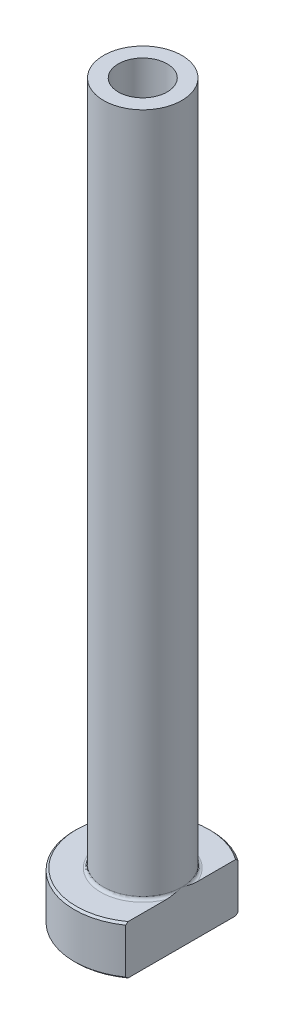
ISO-10303-21;
HEADER;
FILE_DESCRIPTION(('STEP AP214'),'2;1');
FILE_NAME('part.step','',(''),(''),'','','');
FILE_SCHEMA(('AUTOMOTIVE_DESIGN { 1 0 10303 214 1 1 1 1 }'));
ENDSEC;
DATA;
#1=APPLICATION_CONTEXT('core data for automotive mechanical design processes');
#2=APPLICATION_PROTOCOL_DEFINITION('international standard','automotive_design',2000,#1);
#3=PRODUCT_CONTEXT('',#1,'mechanical');
#4=PRODUCT('Part','Part','',(#3));
#5=PRODUCT_RELATED_PRODUCT_CATEGORY('part','',(#4));
#6=PRODUCT_DEFINITION_FORMATION('','',#4);
#7=PRODUCT_DEFINITION_CONTEXT('part definition',#1,'design');
#8=PRODUCT_DEFINITION('design','',#6,#7);
#9=PRODUCT_DEFINITION_SHAPE('','',#8);
#10=(LENGTH_UNIT() NAMED_UNIT(*) SI_UNIT(.MILLI.,.METRE.));
#11=(NAMED_UNIT(*) PLANE_ANGLE_UNIT() SI_UNIT($,.RADIAN.));
#12=(NAMED_UNIT(*) SI_UNIT($,.STERADIAN.) SOLID_ANGLE_UNIT());
#13=UNCERTAINTY_MEASURE_WITH_UNIT(LENGTH_MEASURE(1.E-05),#10,'distance_accuracy_value','');
#14=(GEOMETRIC_REPRESENTATION_CONTEXT(3) GLOBAL_UNCERTAINTY_ASSIGNED_CONTEXT((#13)) GLOBAL_UNIT_ASSIGNED_CONTEXT((#10,
#11,#12)) REPRESENTATION_CONTEXT('',''));
#15=CARTESIAN_POINT('',(0.,0.,0.));
#16=DIRECTION('',(0.,0.,1.));
#17=DIRECTION('',(1.,0.,0.));
#18=AXIS2_PLACEMENT_3D('',#15,#16,#17);
#19=CARTESIAN_POINT('',(0.,92.1876809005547,0.));
#20=DIRECTION('',(0.,1.,0.));
#21=DIRECTION('',(0.,0.,1.));
#22=AXIS2_PLACEMENT_3D('',#19,#20,#21);
#23=CYLINDRICAL_SURFACE('',#22,2.50000000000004);
#24=CARTESIAN_POINT('',(0.,75.,0.));
#25=DIRECTION('',(0.,1.,0.));
#26=DIRECTION('',(0.,0.,1.));
#27=AXIS2_PLACEMENT_3D('',#24,#25,#26);
#28=CIRCLE('',#27,2.50000000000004);
#29=CARTESIAN_POINT('',(0.,75.,2.50000000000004));
#30=VERTEX_POINT('',#29);
#31=EDGE_CURVE('E167',#30,#30,#28,.T.);
#32=ORIENTED_EDGE('',*,*,#31,.T.);
#33=EDGE_LOOP('',(#32));
#34=FACE_BOUND('',#33,.T.);
#35=CARTESIAN_POINT('',(0.,30.,0.));
#36=DIRECTION('',(0.,1.,0.));
#37=DIRECTION('',(0.,0.,1.));
#38=AXIS2_PLACEMENT_3D('',#35,#36,#37);
#39=CIRCLE('',#38,2.50000000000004);
#40=CARTESIAN_POINT('',(0.,30.,2.50000000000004));
#41=VERTEX_POINT('',#40);
#42=EDGE_CURVE('E170',#41,#41,#39,.T.);
#43=ORIENTED_EDGE('',*,*,#42,.F.);
#44=EDGE_LOOP('',(#43));
#45=FACE_BOUND('',#44,.T.);
#46=ADVANCED_FACE('F32',(#34,#45),#23,.F.);
#47=CARTESIAN_POINT('',(-2.50000000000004,75.,0.));
#48=DIRECTION('',(0.,1.,0.));
#49=DIRECTION('',(0.,0.,1.));
#50=AXIS2_PLACEMENT_3D('',#47,#48,#49);
#51=PLANE('',#50);
#52=CARTESIAN_POINT('',(0.,75.,0.));
#53=DIRECTION('',(0.,1.,0.));
#54=DIRECTION('',(0.,0.,1.));
#55=AXIS2_PLACEMENT_3D('',#52,#53,#54);
#56=CIRCLE('',#55,4.);
#57=CARTESIAN_POINT('',(0.,75.,4.));
#58=VERTEX_POINT('',#57);
#59=EDGE_CURVE('E174',#58,#58,#56,.T.);
#60=ORIENTED_EDGE('',*,*,#59,.T.);
#61=EDGE_LOOP('',(#60));
#62=FACE_BOUND('',#61,.T.);
#63=ORIENTED_EDGE('',*,*,#31,.F.);
#64=EDGE_LOOP('',(#63));
#65=FACE_BOUND('',#64,.T.);
#66=ADVANCED_FACE('F157',(#62,#65),#51,.T.);
#67=CARTESIAN_POINT('',(0.,92.1876809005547,0.));
#68=DIRECTION('',(0.,1.,0.));
#69=DIRECTION('',(0.,0.,1.));
#70=AXIS2_PLACEMENT_3D('',#67,#68,#69);
#71=CYLINDRICAL_SURFACE('',#70,3.99999999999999);
#72=CARTESIAN_POINT('',(0.,5.3,0.));
#73=DIRECTION('',(0.,1.,0.));
#74=DIRECTION('',(0.,0.,1.));
#75=AXIS2_PLACEMENT_3D('',#72,#73,#74);
#76=CIRCLE('',#75,3.99999999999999);
#77=CARTESIAN_POINT('',(3.99999999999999,5.3,0.));
#78=VERTEX_POINT('',#77);
#79=EDGE_CURVE('E180',#78,#78,#76,.T.);
#80=ORIENTED_EDGE('',*,*,#79,.T.);
#81=EDGE_LOOP('',(#80));
#82=FACE_BOUND('',#81,.T.);
#83=ORIENTED_EDGE('',*,*,#59,.F.);
#84=EDGE_LOOP('',(#83));
#85=FACE_BOUND('',#84,.T.);
#86=ADVANCED_FACE('F162',(#82,#85),#71,.T.);
#87=CARTESIAN_POINT('',(-3.99999999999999,5.,0.));
#88=DIRECTION('',(0.,1.,0.));
#89=DIRECTION('',(0.,0.,1.));
#90=AXIS2_PLACEMENT_3D('',#87,#88,#89);
#91=PLANE('',#90);
#92=DIRECTION('',(0.,0.,1.));
#93=VECTOR('',#92,1.);
#94=CARTESIAN_POINT('',(4.,5.,0.));
#95=LINE('',#94,#93);
#96=CARTESIAN_POINT('',(4.,5.,-5.49909083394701));
#97=VERTEX_POINT('',#96);
#98=CARTESIAN_POINT('',(4.,5.,-1.57797338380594));
#99=VERTEX_POINT('',#98);
#100=EDGE_CURVE('E54',#97,#99,#95,.T.);
#101=ORIENTED_EDGE('',*,*,#100,.F.);
#102=CARTESIAN_POINT('',(0.,5.,0.));
#103=DIRECTION('',(0.,1.,0.));
#104=DIRECTION('',(0.,0.,1.));
#105=AXIS2_PLACEMENT_3D('',#102,#103,#104);
#106=CIRCLE('',#105,6.8);
#107=CARTESIAN_POINT('',(3.99999999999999,5.,5.49909083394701));
#108=VERTEX_POINT('',#107);
#109=EDGE_CURVE('E186',#97,#108,#106,.T.);
#110=ORIENTED_EDGE('',*,*,#109,.T.);
#111=CARTESIAN_POINT('',(4.,5.,1.57797338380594));
#112=VERTEX_POINT('',#111);
#113=EDGE_CURVE('E134',#112,#108,#95,.T.);
#114=ORIENTED_EDGE('',*,*,#113,.F.);
#115=CARTESIAN_POINT('',(0.,5.,0.));
#116=DIRECTION('',(0.,1.,0.));
#117=DIRECTION('',(0.,0.,1.));
#118=AXIS2_PLACEMENT_3D('',#115,#116,#117);
#119=CIRCLE('',#118,4.29999999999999);
#120=EDGE_CURVE('E183',#112,#99,#119,.F.);
#121=ORIENTED_EDGE('',*,*,#120,.T.);
#122=EDGE_LOOP('',(#101,#110,#114,#121));
#123=FACE_BOUND('',#122,.T.);
#124=ADVANCED_FACE('F197',(#123),#91,.T.);
#125=CARTESIAN_POINT('',(0.,92.1876809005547,0.));
#126=DIRECTION('',(0.,1.,0.));
#127=DIRECTION('',(0.,0.,1.));
#128=AXIS2_PLACEMENT_3D('',#125,#126,#127);
#129=CYLINDRICAL_SURFACE('',#128,6.99999999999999);
#130=DIRECTION('',(0.,-1.,0.));
#131=VECTOR('',#130,1.);
#132=CARTESIAN_POINT('',(3.99999999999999,75.,5.74456264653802));
#133=LINE('',#132,#131);
#134=CARTESIAN_POINT('',(3.99999999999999,4.8,5.74456264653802));
#135=VERTEX_POINT('',#134);
#136=CARTESIAN_POINT('',(3.99999999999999,0.199999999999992,5.74456264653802));
#137=VERTEX_POINT('',#136);
#138=EDGE_CURVE('E82',#135,#137,#133,.T.);
#139=ORIENTED_EDGE('',*,*,#138,.F.);
#140=CARTESIAN_POINT('',(0.,4.8,0.));
#141=DIRECTION('',(0.,1.,0.));
#142=DIRECTION('',(0.,0.,1.));
#143=AXIS2_PLACEMENT_3D('',#140,#141,#142);
#144=CIRCLE('',#143,6.99999999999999);
#145=CARTESIAN_POINT('',(4.,4.8,-5.74456264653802));
#146=VERTEX_POINT('',#145);
#147=EDGE_CURVE('E95',#135,#146,#144,.F.);
#148=ORIENTED_EDGE('',*,*,#147,.T.);
#149=DIRECTION('',(0.,-1.,0.));
#150=VECTOR('',#149,1.);
#151=CARTESIAN_POINT('',(4.,75.,-5.74456264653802));
#152=LINE('',#151,#150);
#153=CARTESIAN_POINT('',(4.,0.199999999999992,-5.74456264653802));
#154=VERTEX_POINT('',#153);
#155=EDGE_CURVE('E192',#146,#154,#152,.T.);
#156=ORIENTED_EDGE('',*,*,#155,.T.);
#157=CARTESIAN_POINT('',(0.,0.199999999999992,0.));
#158=DIRECTION('',(0.,-1.,0.));
#159=DIRECTION('',(0.,0.,-1.));
#160=AXIS2_PLACEMENT_3D('',#157,#158,#159);
#161=CIRCLE('',#160,6.99999999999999);
#162=EDGE_CURVE('E98',#154,#137,#161,.F.);
#163=ORIENTED_EDGE('',*,*,#162,.T.);
#164=EDGE_LOOP('',(#139,#148,#156,#163));
#165=FACE_BOUND('',#164,.T.);
#166=ADVANCED_FACE('F190',(#165),#129,.T.);
#167=CARTESIAN_POINT('',(-6.99999999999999,0.,0.));
#168=DIRECTION('',(0.,-1.,0.));
#169=DIRECTION('',(0.,0.,-1.));
#170=AXIS2_PLACEMENT_3D('',#167,#168,#169);
#171=PLANE('',#170);
#172=CARTESIAN_POINT('',(0.,0.,0.));
#173=DIRECTION('',(0.,-1.,0.));
#174=DIRECTION('',(0.,0.,-1.));
#175=AXIS2_PLACEMENT_3D('',#172,#173,#174);
#176=CIRCLE('',#175,3.25);
#177=CARTESIAN_POINT('',(0.,0.,-3.25));
#178=VERTEX_POINT('',#177);
#179=EDGE_CURVE('E40',#178,#178,#176,.F.);
#180=ORIENTED_EDGE('',*,*,#179,.T.);
#181=EDGE_LOOP('',(#180));
#182=FACE_BOUND('',#181,.T.);
#183=DIRECTION('',(0.,0.,-1.));
#184=VECTOR('',#183,1.);
#185=CARTESIAN_POINT('',(3.99999999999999,0.,5.74456264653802));
#186=LINE('',#185,#184);
#187=CARTESIAN_POINT('',(3.99999999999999,0.,5.49909083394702));
#188=VERTEX_POINT('',#187);
#189=CARTESIAN_POINT('',(4.,0.,-5.49909083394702));
#190=VERTEX_POINT('',#189);
#191=EDGE_CURVE('E47',#188,#190,#186,.T.);
#192=ORIENTED_EDGE('',*,*,#191,.F.);
#193=CARTESIAN_POINT('',(0.,0.,0.));
#194=DIRECTION('',(0.,-1.,0.));
#195=DIRECTION('',(0.,0.,-1.));
#196=AXIS2_PLACEMENT_3D('',#193,#194,#195);
#197=CIRCLE('',#196,6.80000000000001);
#198=EDGE_CURVE('E92',#188,#190,#197,.T.);
#199=ORIENTED_EDGE('',*,*,#198,.T.);
#200=EDGE_LOOP('',(#192,#199));
#201=FACE_BOUND('',#200,.T.);
#202=ADVANCED_FACE('F91',(#182,#201),#171,.T.);
#203=CARTESIAN_POINT('',(0.,92.1876809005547,0.));
#204=DIRECTION('',(0.,1.,0.));
#205=DIRECTION('',(0.,0.,1.));
#206=AXIS2_PLACEMENT_3D('',#203,#204,#205);
#207=CYLINDRICAL_SURFACE('',#206,2.74999999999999);
#208=CARTESIAN_POINT('',(0.,0.5,0.));
#209=DIRECTION('',(0.,-1.,0.));
#210=DIRECTION('',(0.,0.,-1.));
#211=AXIS2_PLACEMENT_3D('',#208,#209,#210);
#212=CIRCLE('',#211,2.74999999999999);
#213=CARTESIAN_POINT('',(0.,0.5,-2.74999999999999));
#214=VERTEX_POINT('',#213);
#215=EDGE_CURVE('E11',#214,#214,#212,.T.);
#216=ORIENTED_EDGE('',*,*,#215,.T.);
#217=EDGE_LOOP('',(#216));
#218=FACE_BOUND('',#217,.T.);
#219=CARTESIAN_POINT('',(0.,18.,0.));
#220=DIRECTION('',(0.,1.,0.));
#221=DIRECTION('',(0.,0.,1.));
#222=AXIS2_PLACEMENT_3D('',#219,#220,#221);
#223=CIRCLE('',#222,2.74999999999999);
#224=CARTESIAN_POINT('',(0.,18.,2.74999999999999));
#225=VERTEX_POINT('',#224);
#226=EDGE_CURVE('E172',#225,#225,#223,.T.);
#227=ORIENTED_EDGE('',*,*,#226,.T.);
#228=EDGE_LOOP('',(#227));
#229=FACE_BOUND('',#228,.T.);
#230=ADVANCED_FACE('F215',(#218,#229),#207,.F.);
#231=CARTESIAN_POINT('',(0.,18.,0.));
#232=DIRECTION('',(0.,-1.,0.));
#233=DIRECTION('',(0.,0.,-1.));
#234=AXIS2_PLACEMENT_3D('',#231,#232,#233);
#235=CONICAL_SURFACE('',#234,2.74999999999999,0.0208303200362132);
#236=ORIENTED_EDGE('',*,*,#42,.T.);
#237=EDGE_LOOP('',(#236));
#238=FACE_BOUND('',#237,.T.);
#239=ORIENTED_EDGE('',*,*,#226,.F.);
#240=EDGE_LOOP('',(#239));
#241=FACE_BOUND('',#240,.T.);
#242=ADVANCED_FACE('F111',(#238,#241),#235,.F.);
#243=CARTESIAN_POINT('',(0.,5.3,0.));
#244=DIRECTION('',(0.,1.,0.));
#245=DIRECTION('',(0.,0.,1.));
#246=AXIS2_PLACEMENT_3D('',#243,#244,#245);
#247=TOROIDAL_SURFACE('',#246,4.29999999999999,0.3);
#248=ORIENTED_EDGE('',*,*,#120,.F.);
#249=CARTESIAN_POINT('',(3.99999999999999,5.3,0.));
#250=CARTESIAN_POINT('',(3.99999999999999,5.30000062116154,-1.06250692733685E-10));
#251=CARTESIAN_POINT('',(3.99999999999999,5.30000124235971,2.17725991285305E-07));
#252=CARTESIAN_POINT('',(3.99999999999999,5.30000240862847,8.36140834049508E-07));
#253=CARTESIAN_POINT('',(3.99999999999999,5.30000294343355,1.2501166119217E-06));
#254=CARTESIAN_POINT('',(3.99999999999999,5.3000040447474,2.23959309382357E-06));
#255=CARTESIAN_POINT('',(3.99999999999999,5.30000459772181,2.83084427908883E-06));
#256=CARTESIAN_POINT('',(3.99999999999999,5.30000559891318,4.06516564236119E-06));
#257=CARTESIAN_POINT('',(3.99999999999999,5.30000604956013,4.70640046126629E-06));
#258=CARTESIAN_POINT('',(3.99999999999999,5.30000769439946,7.15677144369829E-06));
#259=CARTESIAN_POINT('',(3.99999999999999,5.3000087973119,9.02995892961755E-06));
#260=CARTESIAN_POINT('',(3.99999999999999,5.30001063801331,1.27664878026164E-05));
#261=CARTESIAN_POINT('',(3.99999999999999,5.30001139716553,1.46197798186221E-05));
#262=CARTESIAN_POINT('',(3.99999999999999,5.3000145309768,2.23679207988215E-05));
#263=CARTESIAN_POINT('',(3.99999999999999,5.30001683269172,2.82968730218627E-05));
#264=CARTESIAN_POINT('',(3.99999999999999,5.30002027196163,3.95668707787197E-05));
#265=CARTESIAN_POINT('',(3.99999999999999,5.30002152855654,4.48715441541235E-05));
#266=CARTESIAN_POINT('',(3.99999999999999,5.30003060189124,8.40118167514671E-05));
#267=CARTESIAN_POINT('',(4.,5.30003739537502,0.000118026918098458));
#268=CARTESIAN_POINT('',(4.,5.30006713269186,0.000252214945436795));
#269=CARTESIAN_POINT('',(4.,5.30009559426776,0.000351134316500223));
#270=CARTESIAN_POINT('',(3.99999999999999,5.30020622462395,0.000742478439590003));
#271=CARTESIAN_POINT('',(3.99999999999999,5.30028475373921,0.00103561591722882));
#272=CARTESIAN_POINT('',(4.,5.3005988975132,0.0021992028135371));
#273=CARTESIAN_POINT('',(4.,5.30083905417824,0.0030687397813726));
#274=CARTESIAN_POINT('',(3.99999999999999,5.30183682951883,0.00669141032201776));
#275=CARTESIAN_POINT('',(3.99999999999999,5.30258877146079,0.00944568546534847));
#276=CARTESIAN_POINT('',(4.,5.31066890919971,0.0390293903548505));
#277=CARTESIAN_POINT('',(4.,5.31802631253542,0.0658531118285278));
#278=CARTESIAN_POINT('',(3.99999999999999,5.33239676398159,0.118441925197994));
#279=CARTESIAN_POINT('',(3.99999999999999,5.33941183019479,0.14420651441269));
#280=CARTESIAN_POINT('',(4.,5.35427366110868,0.199017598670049));
#281=CARTESIAN_POINT('',(4.,5.36211313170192,0.228066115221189));
#282=CARTESIAN_POINT('',(4.,5.37776349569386,0.28651184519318));
#283=CARTESIAN_POINT('',(4.,5.38557313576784,0.315909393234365));
#284=CARTESIAN_POINT('',(4.,5.40425662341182,0.386994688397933));
#285=CARTESIAN_POINT('',(4.,5.41505237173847,0.428703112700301));
#286=CARTESIAN_POINT('',(4.,5.43592310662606,0.511098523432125));
#287=CARTESIAN_POINT('',(4.,5.44600969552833,0.551782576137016));
#288=CARTESIAN_POINT('',(4.,5.47850986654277,0.686599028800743));
#289=CARTESIAN_POINT('',(4.,5.49978370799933,0.781011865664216));
#290=CARTESIAN_POINT('',(4.,5.53807543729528,0.971847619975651));
#291=CARTESIAN_POINT('',(4.,5.55504273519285,1.06828120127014));
#292=CARTESIAN_POINT('',(4.,5.57582405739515,1.21752725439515));
#293=CARTESIAN_POINT('',(4.,5.58209796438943,1.26999379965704));
#294=CARTESIAN_POINT('',(4.,5.59210686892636,1.37516324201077));
#295=CARTESIAN_POINT('',(4.,5.59584265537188,1.42786606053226));
#296=CARTESIAN_POINT('',(4.,5.60010438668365,1.53310673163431));
#297=CARTESIAN_POINT('',(4.,5.6006487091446,1.58564378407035));
#298=CARTESIAN_POINT('',(4.,5.59767158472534,1.69058605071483));
#299=CARTESIAN_POINT('',(4.,5.59415502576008,1.74299134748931));
#300=CARTESIAN_POINT('',(4.,5.58503062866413,1.8190329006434));
#301=CARTESIAN_POINT('',(4.,5.58157617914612,1.84292934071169));
#302=CARTESIAN_POINT('',(4.,5.5732995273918,1.89051061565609));
#303=CARTESIAN_POINT('',(4.,5.56847619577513,1.91419525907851));
#304=CARTESIAN_POINT('',(4.,5.55726644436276,1.96092888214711));
#305=CARTESIAN_POINT('',(4.,5.55089740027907,1.98398195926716));
#306=CARTESIAN_POINT('',(4.,5.53623434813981,2.0294555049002));
#307=CARTESIAN_POINT('',(4.,5.52794253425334,2.05187666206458));
#308=CARTESIAN_POINT('',(4.,5.50887098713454,2.09590631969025));
#309=CARTESIAN_POINT('',(4.,5.49806837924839,2.1175050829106));
#310=CARTESIAN_POINT('',(4.,5.47333401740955,2.15885583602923));
#311=CARTESIAN_POINT('',(4.,5.45941272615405,2.17861369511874));
#312=CARTESIAN_POINT('',(4.,5.43588221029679,2.20522942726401));
#313=CARTESIAN_POINT('',(4.,5.42781139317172,2.21344043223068));
#314=CARTESIAN_POINT('',(4.,5.41065114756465,2.22875149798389));
#315=CARTESIAN_POINT('',(4.,5.40156129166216,2.23585108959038));
#316=CARTESIAN_POINT('',(4.,5.38220524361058,2.24859694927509));
#317=CARTESIAN_POINT('',(4.,5.37192420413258,2.25422119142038));
#318=CARTESIAN_POINT('',(4.,5.35045072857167,2.26331064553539));
#319=CARTESIAN_POINT('',(4.,5.33926122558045,2.26678251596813));
#320=CARTESIAN_POINT('',(4.,5.31952044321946,2.27051268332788));
#321=CARTESIAN_POINT('',(4.,5.31108453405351,2.27139016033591));
#322=CARTESIAN_POINT('',(4.,5.29418624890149,2.2716896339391));
#323=CARTESIAN_POINT('',(4.,5.28572387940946,2.27111196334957));
#324=CARTESIAN_POINT('',(4.,5.26904138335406,2.26855580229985));
#325=CARTESIAN_POINT('',(4.,5.26082066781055,2.26658107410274));
#326=CARTESIAN_POINT('',(4.,5.24478214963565,2.26139496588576));
#327=CARTESIAN_POINT('',(4.,5.23696461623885,2.25818277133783));
#328=CARTESIAN_POINT('',(4.,5.21851235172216,2.24908332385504));
#329=CARTESIAN_POINT('',(4.,5.20815219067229,2.24264095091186));
#330=CARTESIAN_POINT('',(4.,5.18857975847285,2.22819957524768));
#331=CARTESIAN_POINT('',(4.,5.17937061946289,2.22019647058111));
#332=CARTESIAN_POINT('',(4.,5.15665383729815,2.19777756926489));
#333=CARTESIAN_POINT('',(4.,5.14403484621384,2.18246908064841));
#334=CARTESIAN_POINT('',(4.,5.12118369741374,2.15020843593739));
#335=CARTESIAN_POINT('',(4.,5.11095480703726,2.13325407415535));
#336=CARTESIAN_POINT('',(4.,5.09273574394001,2.09892324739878));
#337=CARTESIAN_POINT('',(4.,5.08468212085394,2.08157988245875));
#338=CARTESIAN_POINT('',(4.,5.07005901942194,2.04627072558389));
#339=CARTESIAN_POINT('',(4.,5.06349101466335,2.02830433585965));
#340=CARTESIAN_POINT('',(4.,5.04555485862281,1.97350761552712));
#341=CARTESIAN_POINT('',(4.,5.03608974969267,1.93605770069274));
#342=CARTESIAN_POINT('',(4.,5.0178056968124,1.8452923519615));
#343=CARTESIAN_POINT('',(4.,5.01077018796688,1.79164082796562));
#344=CARTESIAN_POINT('',(4.,5.00182846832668,1.6837994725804));
#345=CARTESIAN_POINT('',(4.,4.99993887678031,1.62960846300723));
#346=CARTESIAN_POINT('',(4.,5.00006129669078,1.52361204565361));
#347=CARTESIAN_POINT('',(4.,5.00190698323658,1.4718055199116));
#348=CARTESIAN_POINT('',(4.,5.00841243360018,1.36835357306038));
#349=CARTESIAN_POINT('',(4.,5.01307376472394,1.31670825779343));
#350=CARTESIAN_POINT('',(4.,5.02905484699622,1.17431887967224));
#351=CARTESIAN_POINT('',(4.,5.04274090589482,1.08384207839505));
#352=CARTESIAN_POINT('',(4.,5.06701714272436,0.947757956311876));
#353=CARTESIAN_POINT('',(4.,5.07585573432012,0.901814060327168));
#354=CARTESIAN_POINT('',(4.,5.09458665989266,0.810008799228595));
#355=CARTESIAN_POINT('',(4.,5.10448180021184,0.764148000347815));
#356=CARTESIAN_POINT('',(4.,5.1289243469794,0.655631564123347));
#357=CARTESIAN_POINT('',(4.,5.14383556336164,0.593058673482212));
#358=CARTESIAN_POINT('',(4.,5.17458762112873,0.468885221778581));
#359=CARTESIAN_POINT('',(4.,5.19041623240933,0.407281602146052));
#360=CARTESIAN_POINT('',(3.99999999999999,5.22090834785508,0.291232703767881));
#361=CARTESIAN_POINT('',(3.99999999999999,5.23550024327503,0.236768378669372));
#362=CARTESIAN_POINT('',(4.,5.26562550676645,0.125604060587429));
#363=CARTESIAN_POINT('',(4.00000000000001,5.28117250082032,0.0689076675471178));
#364=CARTESIAN_POINT('',(3.99999999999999,5.29741226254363,0.00944154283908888));
#365=CARTESIAN_POINT('',(3.99999999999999,5.29816540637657,0.00668315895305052));
#366=CARTESIAN_POINT('',(4.,5.29916346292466,0.00305954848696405));
#367=CARTESIAN_POINT('',(4.,5.29940273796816,0.00219318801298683));
#368=CARTESIAN_POINT('',(3.99999999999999,5.29971580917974,0.00103357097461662));
#369=CARTESIAN_POINT('',(3.99999999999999,5.29979412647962,0.000741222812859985));
#370=CARTESIAN_POINT('',(4.,5.29990450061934,0.00035080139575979));
#371=CARTESIAN_POINT('',(4.,5.29993292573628,0.00025201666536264));
#372=CARTESIAN_POINT('',(4.,5.2999626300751,0.000117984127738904));
#373=CARTESIAN_POINT('',(3.99999999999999,5.29996941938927,8.39881851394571E-05));
#374=CARTESIAN_POINT('',(3.99999999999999,5.29997848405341,4.48673984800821E-05));
#375=CARTESIAN_POINT('',(3.99999999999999,5.29997973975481,3.95638156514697E-05));
#376=CARTESIAN_POINT('',(3.99999999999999,5.29998317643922,2.82960308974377E-05));
#377=CARTESIAN_POINT('',(3.99999999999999,5.29998547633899,2.236814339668E-05));
#378=CARTESIAN_POINT('',(3.99999999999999,5.29998860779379,1.46210987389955E-05));
#379=CARTESIAN_POINT('',(3.99999999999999,5.29998936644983,1.27678884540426E-05));
#380=CARTESIAN_POINT('',(3.99999999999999,5.29999120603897,9.03143915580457E-06));
#381=CARTESIAN_POINT('',(3.99999999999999,5.29999230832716,7.1582397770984E-06));
#382=CARTESIAN_POINT('',(3.99999999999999,5.29999395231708,4.70775453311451E-06));
#383=CARTESIAN_POINT('',(3.99999999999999,5.29999440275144,4.06646315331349E-06));
#384=CARTESIAN_POINT('',(3.99999999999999,5.2999954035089,2.83199030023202E-06));
#385=CARTESIAN_POINT('',(3.99999999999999,5.29999595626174,2.24064296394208E-06));
#386=CARTESIAN_POINT('',(3.99999999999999,5.29999705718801,1.25093940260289E-06));
#387=CARTESIAN_POINT('',(3.99999999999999,5.29999759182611,8.36840805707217E-07));
#388=CARTESIAN_POINT('',(3.99999999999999,5.29999875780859,2.18117629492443E-07));
#389=CARTESIAN_POINT('',(3.99999999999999,5.29999937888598,1.06243770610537E-10));
#390=CARTESIAN_POINT('',(3.99999999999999,5.3,0.));
#391=B_SPLINE_CURVE_WITH_KNOTS('',3,(#249,#250,#251,#252,#253,#254,#255,#256,#257,#258,#259,
#260,#261,#262,#263,#264,#265,#266,#267,#268,#269,#270,#271,#272,#273,#274,#275,#276,#277,#278,
#279,#280,#281,#282,#283,#284,#285,#286,#287,#288,#289,#290,#291,#292,#293,#294,#295,#296,#297,
#298,#299,#300,#301,#302,#303,#304,#305,#306,#307,#308,#309,#310,#311,#312,#313,#314,#315,#316,
#317,#318,#319,#320,#321,#322,#323,#324,#325,#326,#327,#328,#329,#330,#331,#332,#333,#334,#335,
#336,#337,#338,#339,#340,#341,#342,#343,#344,#345,#346,#347,#348,#349,#350,#351,#352,#353,#354,
#355,#356,#357,#358,#359,#360,#361,#362,#363,#364,#365,#366,#367,#368,#369,#370,#371,#372,#373,
#374,#375,#376,#377,#378,#379,#380,#381,#382,#383,#384,#385,#386,#387,#388,#389,#390),
.UNSPECIFIED.,.T.,.F.,(4,2,2,2,2,2,2,2,2,2,2,2,2,2,2,2,2,2,2,2,2,2,2,2,2,2,2,2,2,2,2,2,2,2,2,2,
2,2,2,2,2,2,2,2,2,2,2,2,2,2,2,2,2,2,2,2,2,2,2,2,2,2,2,2,2,2,2,2,2,2,4),(0.,1.87484564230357E-06,
3.9018029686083E-06,6.31684198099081E-06,8.66652435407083E-06,1.51627608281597E-05,
2.11658001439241E-05,4.02090842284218E-05,5.65429557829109E-05,0.000160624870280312,
0.000469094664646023,0.00137985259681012,0.00408571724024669,0.0126514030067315,
0.0960918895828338,0.176200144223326,0.266463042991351,0.357714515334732,0.48696124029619,
0.612707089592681,0.902988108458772,1.19653589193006,1.35501075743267,1.51343634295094,
1.6709487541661,1.82827177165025,1.90067591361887,1.97313996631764,2.04482437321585,
2.11642737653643,2.188710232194,2.2607541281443,2.29521947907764,2.32969934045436,
2.36466792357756,2.39952778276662,2.42485422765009,2.45017488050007,2.47542760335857,
2.50069697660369,2.53708899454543,2.57357798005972,2.63276032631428,2.69202310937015,
2.74930315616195,2.80663977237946,2.92223125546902,3.08420752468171,3.24670629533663,
3.40212850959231,3.55763731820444,3.83192962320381,3.9722838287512,4.11302057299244,
4.3059813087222,4.49678885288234,4.66594443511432,4.84230602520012,4.85088453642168,
4.85358051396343,4.8544888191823,4.85479687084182,4.85490089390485,4.85491722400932,
4.85493626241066,4.85494226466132,4.85494875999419,4.85495110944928,4.85495352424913,
4.85495555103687,4.85495742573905),.UNSPECIFIED.);
#392=EDGE_CURVE('E126',#112,#78,#391,.T.);
#393=ORIENTED_EDGE('',*,*,#392,.T.);
#394=ORIENTED_EDGE('',*,*,#79,.F.);
#395=CARTESIAN_POINT('',(3.99999999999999,5.3,0.));
#396=CARTESIAN_POINT('',(3.99999999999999,5.29999937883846,1.0625180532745E-10));
#397=CARTESIAN_POINT('',(3.99999999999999,5.29999875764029,-2.17725990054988E-07));
#398=CARTESIAN_POINT('',(3.99999999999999,5.29999759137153,-8.36140832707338E-07));
#399=CARTESIAN_POINT('',(3.99999999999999,5.29999705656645,-1.25011661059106E-06));
#400=CARTESIAN_POINT('',(3.99999999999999,5.2999959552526,-2.23959309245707E-06));
#401=CARTESIAN_POINT('',(3.99999999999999,5.29999540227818,-2.83084427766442E-06));
#402=CARTESIAN_POINT('',(3.99999999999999,5.29999440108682,-4.06516564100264E-06));
#403=CARTESIAN_POINT('',(3.99999999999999,5.29999395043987,-4.70640046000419E-06));
#404=CARTESIAN_POINT('',(3.99999999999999,5.29999230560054,-7.15677144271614E-06));
#405=CARTESIAN_POINT('',(3.99999999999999,5.2999912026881,-9.02995892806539E-06));
#406=CARTESIAN_POINT('',(3.99999999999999,5.29998936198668,-1.27664878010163E-05));
#407=CARTESIAN_POINT('',(3.99999999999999,5.29998860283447,-1.46197798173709E-05));
#408=CARTESIAN_POINT('',(3.99999999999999,5.2999854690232,-2.23679207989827E-05));
#409=CARTESIAN_POINT('',(3.99999999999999,5.29998316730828,-2.82968730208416E-05));
#410=CARTESIAN_POINT('',(3.99999999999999,5.29997972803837,-3.95668707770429E-05));
#411=CARTESIAN_POINT('',(3.99999999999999,5.29997847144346,-4.48715441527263E-05));
#412=CARTESIAN_POINT('',(3.99999999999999,5.29996939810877,-8.40118167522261E-05));
#413=CARTESIAN_POINT('',(4.,5.29996260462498,-0.000118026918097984));
#414=CARTESIAN_POINT('',(4.,5.29993286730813,-0.000252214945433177));
#415=CARTESIAN_POINT('',(4.,5.29990440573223,-0.000351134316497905));
#416=CARTESIAN_POINT('',(3.99999999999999,5.29979377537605,-0.000742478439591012));
#417=CARTESIAN_POINT('',(3.99999999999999,5.29971524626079,-0.00103561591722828));
#418=CARTESIAN_POINT('',(4.,5.29940110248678,-0.00219920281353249));
#419=CARTESIAN_POINT('',(4.,5.29916094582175,-0.00306873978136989));
#420=CARTESIAN_POINT('',(3.99999999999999,5.29816317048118,-0.00669141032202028));
#421=CARTESIAN_POINT('',(3.99999999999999,5.29741122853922,-0.00944568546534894));
#422=CARTESIAN_POINT('',(4.,5.28933109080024,-0.0390293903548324));
#423=CARTESIAN_POINT('',(4.,5.28197368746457,-0.0658531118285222));
#424=CARTESIAN_POINT('',(3.99999999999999,5.26760323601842,-0.118441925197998));
#425=CARTESIAN_POINT('',(3.99999999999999,5.26058816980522,-0.144206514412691));
#426=CARTESIAN_POINT('',(4.,5.24572633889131,-0.199017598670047));
#427=CARTESIAN_POINT('',(4.,5.23788686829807,-0.228066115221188));
#428=CARTESIAN_POINT('',(4.,5.22223650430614,-0.28651184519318));
#429=CARTESIAN_POINT('',(4.,5.21442686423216,-0.315909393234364));
#430=CARTESIAN_POINT('',(4.,5.19574337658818,-0.386994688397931));
#431=CARTESIAN_POINT('',(4.,5.18494762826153,-0.428703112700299));
#432=CARTESIAN_POINT('',(4.,5.16407689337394,-0.511098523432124));
#433=CARTESIAN_POINT('',(4.,5.15399030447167,-0.551782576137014));
#434=CARTESIAN_POINT('',(4.,5.12149013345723,-0.68659902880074));
#435=CARTESIAN_POINT('',(4.,5.10021629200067,-0.781011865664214));
#436=CARTESIAN_POINT('',(4.,5.06192456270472,-0.97184761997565));
#437=CARTESIAN_POINT('',(4.,5.04495726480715,-1.06828120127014));
#438=CARTESIAN_POINT('',(4.,5.02417594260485,-1.21752725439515));
#439=CARTESIAN_POINT('',(4.,5.01790203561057,-1.26999379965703));
#440=CARTESIAN_POINT('',(4.,5.00789313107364,-1.37516324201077));
#441=CARTESIAN_POINT('',(4.,5.00415734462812,-1.42786606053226));
#442=CARTESIAN_POINT('',(4.,4.99989561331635,-1.5331067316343));
#443=CARTESIAN_POINT('',(4.,4.9993512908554,-1.58564378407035));
#444=CARTESIAN_POINT('',(4.,5.00232841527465,-1.69058605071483));
#445=CARTESIAN_POINT('',(4.,5.00584497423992,-1.74299134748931));
#446=CARTESIAN_POINT('',(4.,5.01496937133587,-1.8190329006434));
#447=CARTESIAN_POINT('',(4.,5.01842382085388,-1.84292934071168));
#448=CARTESIAN_POINT('',(4.,5.0267004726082,-1.89051061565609));
#449=CARTESIAN_POINT('',(4.,5.03152380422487,-1.9141952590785));
#450=CARTESIAN_POINT('',(4.,5.04273355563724,-1.96092888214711));
#451=CARTESIAN_POINT('',(4.,5.04910259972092,-1.98398195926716));
#452=CARTESIAN_POINT('',(4.,5.06376565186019,-2.0294555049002));
#453=CARTESIAN_POINT('',(4.,5.07205746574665,-2.05187666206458));
#454=CARTESIAN_POINT('',(4.,5.09112901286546,-2.09590631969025));
#455=CARTESIAN_POINT('',(4.,5.10193162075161,-2.1175050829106));
#456=CARTESIAN_POINT('',(4.,5.12666598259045,-2.15885583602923));
#457=CARTESIAN_POINT('',(4.,5.14058727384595,-2.17861369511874));
#458=CARTESIAN_POINT('',(4.,5.16411778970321,-2.20522942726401));
#459=CARTESIAN_POINT('',(4.,5.17218860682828,-2.21344043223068));
#460=CARTESIAN_POINT('',(4.,5.18934885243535,-2.22875149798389));
#461=CARTESIAN_POINT('',(4.,5.19843870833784,-2.23585108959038));
#462=CARTESIAN_POINT('',(4.,5.21779475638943,-2.24859694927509));
#463=CARTESIAN_POINT('',(4.,5.22807579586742,-2.25422119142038));
#464=CARTESIAN_POINT('',(4.,5.24954927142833,-2.26331064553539));
#465=CARTESIAN_POINT('',(4.,5.26073877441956,-2.26678251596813));
#466=CARTESIAN_POINT('',(4.,5.28047955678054,-2.27051268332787));
#467=CARTESIAN_POINT('',(4.,5.28891546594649,-2.27139016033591));
#468=CARTESIAN_POINT('',(4.,5.30581375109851,-2.2716896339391));
#469=CARTESIAN_POINT('',(4.,5.31427612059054,-2.27111196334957));
#470=CARTESIAN_POINT('',(4.,5.33095861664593,-2.26855580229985));
#471=CARTESIAN_POINT('',(4.,5.33917933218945,-2.26658107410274));
#472=CARTESIAN_POINT('',(4.,5.35521785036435,-2.26139496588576));
#473=CARTESIAN_POINT('',(4.,5.36303538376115,-2.25818277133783));
#474=CARTESIAN_POINT('',(4.,5.38148764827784,-2.24908332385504));
#475=CARTESIAN_POINT('',(4.,5.3918478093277,-2.24264095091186));
#476=CARTESIAN_POINT('',(4.,5.41142024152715,-2.22819957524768));
#477=CARTESIAN_POINT('',(4.,5.4206293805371,-2.22019647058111));
#478=CARTESIAN_POINT('',(4.,5.44334616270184,-2.19777756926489));
#479=CARTESIAN_POINT('',(4.,5.45596515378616,-2.18246908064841));
#480=CARTESIAN_POINT('',(4.,5.47881630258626,-2.15020843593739));
#481=CARTESIAN_POINT('',(4.,5.48904519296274,-2.13325407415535));
#482=CARTESIAN_POINT('',(4.,5.50726425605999,-2.09892324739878));
#483=CARTESIAN_POINT('',(4.,5.51531787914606,-2.08157988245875));
#484=CARTESIAN_POINT('',(4.,5.52994098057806,-2.04627072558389));
#485=CARTESIAN_POINT('',(4.,5.53650898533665,-2.02830433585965));
#486=CARTESIAN_POINT('',(4.,5.55444514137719,-1.97350761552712));
#487=CARTESIAN_POINT('',(4.,5.56391025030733,-1.93605770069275));
#488=CARTESIAN_POINT('',(4.,5.5821943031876,-1.8452923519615));
#489=CARTESIAN_POINT('',(4.,5.58922981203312,-1.79164082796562));
#490=CARTESIAN_POINT('',(4.,5.59817153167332,-1.6837994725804));
#491=CARTESIAN_POINT('',(4.,5.60006112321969,-1.62960846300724));
#492=CARTESIAN_POINT('',(4.,5.59993870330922,-1.52361204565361));
#493=CARTESIAN_POINT('',(4.,5.59809301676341,-1.47180551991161));
#494=CARTESIAN_POINT('',(4.,5.59158756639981,-1.36835357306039));
#495=CARTESIAN_POINT('',(4.,5.58692623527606,-1.31670825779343));
#496=CARTESIAN_POINT('',(4.,5.57094515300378,-1.17431887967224));
#497=CARTESIAN_POINT('',(4.,5.55725909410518,-1.08384207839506));
#498=CARTESIAN_POINT('',(4.,5.53298285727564,-0.947757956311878));
#499=CARTESIAN_POINT('',(4.,5.52414426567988,-0.901814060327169));
#500=CARTESIAN_POINT('',(4.,5.50541334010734,-0.810008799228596));
#501=CARTESIAN_POINT('',(4.,5.49551819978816,-0.764148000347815));
#502=CARTESIAN_POINT('',(4.,5.4710756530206,-0.655631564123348));
#503=CARTESIAN_POINT('',(4.,5.45616443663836,-0.593058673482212));
#504=CARTESIAN_POINT('',(4.,5.42541237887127,-0.468885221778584));
#505=CARTESIAN_POINT('',(4.,5.40958376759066,-0.407281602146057));
#506=CARTESIAN_POINT('',(3.99999999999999,5.37909165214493,-0.29123270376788));
#507=CARTESIAN_POINT('',(3.99999999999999,5.364499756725,-0.236768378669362));
#508=CARTESIAN_POINT('',(4.,5.33437449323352,-0.125604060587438));
#509=CARTESIAN_POINT('',(4.00000000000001,5.31882749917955,-0.0689076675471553));
#510=CARTESIAN_POINT('',(3.99999999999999,5.30258773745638,-0.00944154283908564));
#511=CARTESIAN_POINT('',(3.99999999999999,5.30183459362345,-0.00668315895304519));
#512=CARTESIAN_POINT('',(4.,5.30083653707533,-0.00305954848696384));
#513=CARTESIAN_POINT('',(4.,5.30059726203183,-0.00219318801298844));
#514=CARTESIAN_POINT('',(3.99999999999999,5.30028419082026,-0.00103357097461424));
#515=CARTESIAN_POINT('',(3.99999999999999,5.30020587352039,-0.000741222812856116));
#516=CARTESIAN_POINT('',(4.,5.30009549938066,-0.000350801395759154));
#517=CARTESIAN_POINT('',(4.,5.30006707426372,-0.000252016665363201));
#518=CARTESIAN_POINT('',(4.,5.30003736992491,-0.000117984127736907));
#519=CARTESIAN_POINT('',(3.99999999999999,5.30003058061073,-8.39881851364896E-05));
#520=CARTESIAN_POINT('',(3.99999999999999,5.30002151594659,-4.48673984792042E-05));
#521=CARTESIAN_POINT('',(3.99999999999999,5.30002026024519,-3.95638156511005E-05));
#522=CARTESIAN_POINT('',(3.99999999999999,5.30001682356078,-2.82960308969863E-05));
#523=CARTESIAN_POINT('',(3.99999999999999,5.30001452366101,-2.23681433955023E-05));
#524=CARTESIAN_POINT('',(3.99999999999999,5.30001139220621,-1.4621098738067E-05));
#525=CARTESIAN_POINT('',(3.99999999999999,5.30001063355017,-1.27678884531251E-05));
#526=CARTESIAN_POINT('',(3.99999999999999,5.30000879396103,-9.03143915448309E-06));
#527=CARTESIAN_POINT('',(3.99999999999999,5.30000769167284,-7.15823977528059E-06));
#528=CARTESIAN_POINT('',(3.99999999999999,5.30000604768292,-4.70775453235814E-06));
#529=CARTESIAN_POINT('',(3.99999999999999,5.30000559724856,-4.06646315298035E-06));
#530=CARTESIAN_POINT('',(3.99999999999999,5.3000045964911,-2.83199029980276E-06));
#531=CARTESIAN_POINT('',(3.99999999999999,5.30000404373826,-2.24064296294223E-06));
#532=CARTESIAN_POINT('',(3.99999999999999,5.30000294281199,-1.25093940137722E-06));
#533=CARTESIAN_POINT('',(3.99999999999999,5.30000240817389,-8.36840804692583E-07));
#534=CARTESIAN_POINT('',(3.99999999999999,5.30000124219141,-2.18117628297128E-07));
#535=CARTESIAN_POINT('',(3.99999999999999,5.30000062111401,-1.06242467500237E-10));
#536=CARTESIAN_POINT('',(3.99999999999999,5.3,0.));
#537=B_SPLINE_CURVE_WITH_KNOTS('',3,(#395,#396,#397,#398,#399,#400,#401,#402,#403,#404,#405,
#406,#407,#408,#409,#410,#411,#412,#413,#414,#415,#416,#417,#418,#419,#420,#421,#422,#423,#424,
#425,#426,#427,#428,#429,#430,#431,#432,#433,#434,#435,#436,#437,#438,#439,#440,#441,#442,#443,
#444,#445,#446,#447,#448,#449,#450,#451,#452,#453,#454,#455,#456,#457,#458,#459,#460,#461,#462,
#463,#464,#465,#466,#467,#468,#469,#470,#471,#472,#473,#474,#475,#476,#477,#478,#479,#480,#481,
#482,#483,#484,#485,#486,#487,#488,#489,#490,#491,#492,#493,#494,#495,#496,#497,#498,#499,#500,
#501,#502,#503,#504,#505,#506,#507,#508,#509,#510,#511,#512,#513,#514,#515,#516,#517,#518,#519,
#520,#521,#522,#523,#524,#525,#526,#527,#528,#529,#530,#531,#532,#533,#534,#535,#536),
.UNSPECIFIED.,.T.,.F.,(4,2,2,2,2,2,2,2,2,2,2,2,2,2,2,2,2,2,2,2,2,2,2,2,2,2,2,2,2,2,2,2,2,2,2,2,
2,2,2,2,2,2,2,2,2,2,2,2,2,2,2,2,2,2,2,2,2,2,2,2,2,2,2,2,2,2,2,2,2,2,4),(0.,1.87484564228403E-06,
3.90180296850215E-06,6.31684198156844E-06,8.66652435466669E-06,1.51627608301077E-05,
2.11658001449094E-05,4.02090842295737E-05,5.65429557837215E-05,0.000160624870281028,
0.000469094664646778,0.00137985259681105,0.00408571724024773,0.0126514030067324,
0.0960918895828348,0.176200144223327,0.266463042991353,0.357714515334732,0.48696124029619,
0.612707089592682,0.902988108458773,1.19653589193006,1.35501075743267,1.51343634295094,
1.6709487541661,1.82827177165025,1.90067591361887,1.97313996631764,2.04482437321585,
2.11642737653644,2.188710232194,2.2607541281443,2.29521947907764,2.32969934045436,
2.36466792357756,2.39952778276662,2.4248542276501,2.45017488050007,2.47542760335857,
2.50069697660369,2.53708899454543,2.57357798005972,2.63276032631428,2.69202310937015,
2.74930315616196,2.80663977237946,2.92223125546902,3.0842075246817,3.24670629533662,
3.4021285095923,3.55763731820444,3.83192962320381,3.9722838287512,4.11302057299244,
4.3059813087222,4.49678885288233,4.66594443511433,4.84230602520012,4.85088453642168,
4.85358051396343,4.8544888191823,4.85479687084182,4.85490089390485,4.85491722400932,
4.85493626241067,4.85494226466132,4.85494875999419,4.85495110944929,4.85495352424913,
4.85495555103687,4.85495742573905),.UNSPECIFIED.);
#538=EDGE_CURVE('E135',#78,#99,#537,.T.);
#539=ORIENTED_EDGE('',*,*,#538,.T.);
#540=EDGE_LOOP('',(#248,#393,#394,#539));
#541=FACE_BOUND('',#540,.T.);
#542=ADVANCED_FACE('F141',(#541),#247,.F.);
#543=CARTESIAN_POINT('',(0.,5.,0.));
#544=DIRECTION('',(0.,-1.,0.));
#545=DIRECTION('',(0.,0.,-1.));
#546=AXIS2_PLACEMENT_3D('',#543,#544,#545);
#547=CONICAL_SURFACE('',#546,6.79999999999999,0.785398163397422);
#548=CARTESIAN_POINT('',(4.,-1.45712845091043,-12.6392822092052));
#549=CARTESIAN_POINT('',(4.,-1.24364466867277,-12.4153556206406));
#550=CARTESIAN_POINT('',(4.,-1.03042430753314,-12.1911774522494));
#551=CARTESIAN_POINT('',(4.,-0.604617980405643,-11.7422167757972));
#552=CARTESIAN_POINT('',(4.,-0.392032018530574,-11.5174342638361));
#553=CARTESIAN_POINT('',(4.,0.032462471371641,-11.0670952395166));
#554=CARTESIAN_POINT('',(4.,0.244370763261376,-10.8415385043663));
#555=CARTESIAN_POINT('',(4.,0.667290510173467,-10.3895875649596));
#556=CARTESIAN_POINT('',(4.,0.878301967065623,-10.1631933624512));
#557=CARTESIAN_POINT('',(4.,1.51385375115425,-9.47810122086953));
#558=CARTESIAN_POINT('',(4.,1.93676291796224,-9.017882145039));
#559=CARTESIAN_POINT('',(4.,2.5661233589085,-8.32309905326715));
#560=CARTESIAN_POINT('',(4.,2.77505666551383,-8.0907845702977));
#561=CARTESIAN_POINT('',(4.,3.19080254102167,-7.62426940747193));
#562=CARTESIAN_POINT('',(4.,3.39761512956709,-7.39006874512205));
#563=CARTESIAN_POINT('',(4.,3.87870763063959,-6.83891844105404));
#564=CARTESIAN_POINT('',(4.,4.15190978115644,-6.52102188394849));
#565=CARTESIAN_POINT('',(4.,4.55642425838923,-6.03960901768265));
#566=CARTESIAN_POINT('',(4.,4.69041050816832,-5.87833992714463));
#567=CARTESIAN_POINT('',(4.,4.95616531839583,-5.55398469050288));
#568=CARTESIAN_POINT('',(4.,5.08793391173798,-5.39089857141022));
#569=CARTESIAN_POINT('',(4.,5.34841712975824,-5.06288801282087));
#570=CARTESIAN_POINT('',(4.,5.4771378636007,-4.89796843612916));
#571=CARTESIAN_POINT('',(4.,5.73107494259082,-4.56545535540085));
#572=CARTESIAN_POINT('',(4.,5.85629144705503,-4.39786197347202));
#573=CARTESIAN_POINT('',(4.,6.10211465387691,-4.05948444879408));
#574=CARTESIAN_POINT('',(4.,6.22272435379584,-3.88870249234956));
#575=CARTESIAN_POINT('',(4.,6.45796076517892,-3.54308312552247));
#576=CARTESIAN_POINT('',(4.,6.5725886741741,-3.36824653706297));
#577=CARTESIAN_POINT('',(4.,6.76866603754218,-3.05381396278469));
#578=CARTESIAN_POINT('',(4.,6.85173773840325,-2.91523359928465));
#579=CARTESIAN_POINT('',(4.,7.01174537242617,-2.63451965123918));
#580=CARTESIAN_POINT('',(4.,7.08868042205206,-2.49238555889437));
#581=CARTESIAN_POINT('',(4.,7.23459437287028,-2.20416961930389));
#582=CARTESIAN_POINT('',(4.,7.3035783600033,-2.05809037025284));
#583=CARTESIAN_POINT('',(4.,7.43135520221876,-1.76151732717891));
#584=CARTESIAN_POINT('',(4.,7.49015114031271,-1.61102488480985));
#585=CARTESIAN_POINT('',(4.,7.58249315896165,-1.3414209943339));
#586=CARTESIAN_POINT('',(4.,7.61872660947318,-1.2232350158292));
#587=CARTESIAN_POINT('',(4.,7.6822335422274,-0.98449286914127));
#588=CARTESIAN_POINT('',(4.,7.70951040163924,-0.863937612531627));
#589=CARTESIAN_POINT('',(4.,7.75377914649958,-0.62134258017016));
#590=CARTESIAN_POINT('',(4.,7.77080509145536,-0.499309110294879));
#591=CARTESIAN_POINT('',(4.,7.7937877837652,-0.254194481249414));
#592=CARTESIAN_POINT('',(4.,7.79974523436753,-0.131113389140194));
#593=CARTESIAN_POINT('',(4.,7.80023957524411,0.115517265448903));
#594=CARTESIAN_POINT('',(4.,7.79473514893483,0.239066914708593));
#595=CARTESIAN_POINT('',(4.,7.77255119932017,0.485148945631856));
#596=CARTESIAN_POINT('',(4.,7.75587091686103,0.60768125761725));
#597=CARTESIAN_POINT('',(4.,7.71218353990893,0.851269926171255));
#598=CARTESIAN_POINT('',(4.,7.6851436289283,0.972320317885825));
#599=CARTESIAN_POINT('',(4.,7.62201202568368,1.21200276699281));
#600=CARTESIAN_POINT('',(4.,7.58591962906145,1.3306346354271));
#601=CARTESIAN_POINT('',(4.,7.45980070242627,1.70122439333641));
#602=CARTESIAN_POINT('',(4.,7.35572950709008,1.94843335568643));
#603=CARTESIAN_POINT('',(4.,7.18186715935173,2.31048534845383));
#604=CARTESIAN_POINT('',(4.,7.12087684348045,2.42983561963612));
#605=CARTESIAN_POINT('',(4.,6.99403531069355,2.66593629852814));
#606=CARTESIAN_POINT('',(3.99999999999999,6.92818466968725,2.78268701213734));
#607=CARTESIAN_POINT('',(3.99999999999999,6.79157875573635,3.0155089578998));
#608=CARTESIAN_POINT('',(3.99999999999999,6.72076681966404,3.13154660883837));
#609=CARTESIAN_POINT('',(3.99999999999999,6.57583116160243,3.36153379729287));
#610=CARTESIAN_POINT('',(3.99999999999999,6.50170736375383,3.4754832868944));
#611=CARTESIAN_POINT('',(3.99999999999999,6.35080982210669,3.70145107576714));
#612=CARTESIAN_POINT('',(3.99999999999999,6.27403866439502,3.81347110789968));
#613=CARTESIAN_POINT('',(3.99999999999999,6.11824120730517,4.03592316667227));
#614=CARTESIAN_POINT('',(3.99999999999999,6.03921496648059,4.1463552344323));
#615=CARTESIAN_POINT('',(3.99999999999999,5.81506547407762,4.4539715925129));
#616=CARTESIAN_POINT('',(3.99999999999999,5.66782256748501,4.64961120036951));
#617=CARTESIAN_POINT('',(3.99999999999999,5.36880597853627,5.03740600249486));
#618=CARTESIAN_POINT('',(3.99999999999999,5.21703183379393,5.22956083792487));
#619=CARTESIAN_POINT('',(3.99999999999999,4.90999105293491,5.61115465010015));
#620=CARTESIAN_POINT('',(3.99999999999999,4.75472331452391,5.80059273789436));
#621=CARTESIAN_POINT('',(3.99999999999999,4.44150758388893,6.1772436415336));
#622=CARTESIAN_POINT('',(3.99999999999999,4.28355951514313,6.36445639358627));
#623=CARTESIAN_POINT('',(3.99999999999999,3.96525805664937,6.73740614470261));
#624=CARTESIAN_POINT('',(3.99999999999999,3.80490084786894,6.92313987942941));
#625=CARTESIAN_POINT('',(3.99999999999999,3.48247055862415,7.29311320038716));
#626=CARTESIAN_POINT('',(3.99999999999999,3.32039746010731,7.47735277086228));
#627=CARTESIAN_POINT('',(3.99999999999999,2.83216188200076,8.02814826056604));
#628=CARTESIAN_POINT('',(3.99999999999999,2.50391696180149,8.39285790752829));
#629=CARTESIAN_POINT('',(3.99999999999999,1.87512078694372,9.0841449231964));
#630=CARTESIAN_POINT('',(3.99999999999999,1.57491666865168,9.41103929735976));
#631=CARTESIAN_POINT('',(3.99999999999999,0.972153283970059,10.0626830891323));
#632=CARTESIAN_POINT('',(3.99999999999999,0.669593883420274,10.3874323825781));
#633=CARTESIAN_POINT('',(3.99999999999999,0.0637759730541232,11.0341169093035));
#634=CARTESIAN_POINT('',(3.99999999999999,-0.239476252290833,11.3560580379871));
#635=CARTESIAN_POINT('',(3.99999999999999,-0.847356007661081,11.9985921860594));
#636=CARTESIAN_POINT('',(3.99999999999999,-1.151983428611,12.3191853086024));
#637=CARTESIAN_POINT('',(3.99999999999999,-1.45712845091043,12.6392822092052));
#638=B_SPLINE_CURVE_WITH_KNOTS('',3,(#548,#549,#550,#551,#552,#553,#554,#555,#556,#557,#558,
#559,#560,#561,#562,#563,#564,#565,#566,#567,#568,#569,#570,#571,#572,#573,#574,#575,#576,#577,
#578,#579,#580,#581,#582,#583,#584,#585,#586,#587,#588,#589,#590,#591,#592,#593,#594,#595,#596,
#597,#598,#599,#600,#601,#602,#603,#604,#605,#606,#607,#608,#609,#610,#611,#612,#613,#614,#615,
#616,#617,#618,#619,#620,#621,#622,#623,#624,#625,#626,#627,#628,#629,#630,#631,#632,#633,#634,
#635,#636,#637),.UNSPECIFIED.,.F.,.F.,(4,2,2,2,2,2,2,2,2,2,2,2,2,2,2,2,2,2,2,2,2,2,2,2,2,2,2,2,
2,2,2,2,2,2,2,2,2,2,2,2,2,2,2,2,4),(0.,0.928152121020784,1.85631024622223,2.78476262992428,
3.71321307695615,5.58823033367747,6.52556078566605,7.46288254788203,8.72028576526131,
9.34927045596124,9.97824580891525,10.6058302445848,11.2333861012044,11.860526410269,
12.4875406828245,12.9721363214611,13.4568016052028,13.9411551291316,14.4253618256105,
14.7959147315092,15.1663277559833,15.5355031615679,15.9046551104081,16.2751400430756,
16.645650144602,17.0173437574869,17.3890663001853,18.1913996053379,18.5934522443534,
18.9954573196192,19.4032100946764,19.8109722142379,20.2183467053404,20.6257106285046,
21.3601838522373,22.0947322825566,22.8295158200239,23.5643203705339,24.3004480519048,
25.0365834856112,26.5085499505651,27.8400191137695,29.1715646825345,30.4983881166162,
31.8251080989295),.UNSPECIFIED.);
#639=EDGE_CURVE('E133',#146,#97,#638,.T.);
#640=ORIENTED_EDGE('',*,*,#639,.F.);
#641=ORIENTED_EDGE('',*,*,#147,.F.);
#642=EDGE_CURVE('E118',#108,#135,#638,.T.);
#643=ORIENTED_EDGE('',*,*,#642,.F.);
#644=ORIENTED_EDGE('',*,*,#109,.F.);
#645=EDGE_LOOP('',(#640,#641,#643,#644));
#646=FACE_BOUND('',#645,.T.);
#647=ADVANCED_FACE('F145',(#646),#547,.T.);
#648=CARTESIAN_POINT('',(0.,0.199999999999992,0.));
#649=DIRECTION('',(0.,1.,0.));
#650=DIRECTION('',(0.,0.,1.));
#651=AXIS2_PLACEMENT_3D('',#648,#649,#650);
#652=CONICAL_SURFACE('',#651,6.99999999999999,0.785398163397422);
#653=CARTESIAN_POINT('',(3.99999999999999,6.45712845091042,12.6392822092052));
#654=CARTESIAN_POINT('',(3.99999999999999,6.24364466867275,12.4153556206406));
#655=CARTESIAN_POINT('',(3.99999999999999,6.03042430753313,12.1911774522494));
#656=CARTESIAN_POINT('',(3.99999999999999,5.60461798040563,11.7422167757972));
#657=CARTESIAN_POINT('',(3.99999999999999,5.39203201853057,11.5174342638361));
#658=CARTESIAN_POINT('',(3.99999999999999,4.96753752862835,11.0670952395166));
#659=CARTESIAN_POINT('',(3.99999999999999,4.75562923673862,10.8415385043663));
#660=CARTESIAN_POINT('',(3.99999999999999,4.33270948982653,10.3895875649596));
#661=CARTESIAN_POINT('',(3.99999999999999,4.12169803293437,10.1631933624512));
#662=CARTESIAN_POINT('',(3.99999999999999,3.48614624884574,9.47810122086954));
#663=CARTESIAN_POINT('',(3.99999999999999,3.06323708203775,9.017882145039));
#664=CARTESIAN_POINT('',(3.99999999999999,2.43387664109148,8.32309905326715));
#665=CARTESIAN_POINT('',(3.99999999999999,2.22494333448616,8.09078457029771));
#666=CARTESIAN_POINT('',(3.99999999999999,1.80919745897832,7.62426940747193));
#667=CARTESIAN_POINT('',(3.99999999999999,1.6023848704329,7.39006874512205));
#668=CARTESIAN_POINT('',(3.99999999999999,1.12129236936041,6.83891844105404));
#669=CARTESIAN_POINT('',(3.99999999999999,0.848090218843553,6.52102188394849));
#670=CARTESIAN_POINT('',(3.99999999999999,0.443575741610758,6.03960901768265));
#671=CARTESIAN_POINT('',(3.99999999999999,0.309589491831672,5.87833992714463));
#672=CARTESIAN_POINT('',(3.99999999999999,0.0438346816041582,5.55398469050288));
#673=CARTESIAN_POINT('',(3.99999999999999,-0.0879339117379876,5.39089857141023));
#674=CARTESIAN_POINT('',(3.99999999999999,-0.348417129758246,5.06288801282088));
#675=CARTESIAN_POINT('',(3.99999999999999,-0.477137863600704,4.89796843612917));
#676=CARTESIAN_POINT('',(3.99999999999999,-0.73107494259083,4.56545535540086));
#677=CARTESIAN_POINT('',(3.99999999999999,-0.856291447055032,4.39786197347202));
#678=CARTESIAN_POINT('',(3.99999999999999,-1.10211465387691,4.05948444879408));
#679=CARTESIAN_POINT('',(3.99999999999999,-1.22272435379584,3.88870249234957));
#680=CARTESIAN_POINT('',(3.99999999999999,-1.45796076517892,3.54308312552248));
#681=CARTESIAN_POINT('',(3.99999999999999,-1.57258867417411,3.36824653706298));
#682=CARTESIAN_POINT('',(3.99999999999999,-1.76866603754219,3.0538139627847));
#683=CARTESIAN_POINT('',(4.,-1.85173773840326,2.91523359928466));
#684=CARTESIAN_POINT('',(4.,-2.01174537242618,2.63451965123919));
#685=CARTESIAN_POINT('',(4.,-2.08868042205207,2.49238555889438));
#686=CARTESIAN_POINT('',(4.,-2.23459437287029,2.2041696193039));
#687=CARTESIAN_POINT('',(4.,-2.30357836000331,2.05809037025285));
#688=CARTESIAN_POINT('',(4.,-2.43135520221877,1.76151732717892));
#689=CARTESIAN_POINT('',(4.,-2.49015114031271,1.61102488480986));
#690=CARTESIAN_POINT('',(4.,-2.58249315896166,1.34142099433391));
#691=CARTESIAN_POINT('',(4.,-2.61872660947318,1.22323501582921));
#692=CARTESIAN_POINT('',(4.,-2.68223354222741,0.984492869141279));
#693=CARTESIAN_POINT('',(4.,-2.70951040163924,0.863937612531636));
#694=CARTESIAN_POINT('',(4.,-2.75377914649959,0.621342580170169));
#695=CARTESIAN_POINT('',(4.,-2.77080509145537,0.499309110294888));
#696=CARTESIAN_POINT('',(4.,-2.79378778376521,0.254194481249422));
#697=CARTESIAN_POINT('',(4.,-2.79974523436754,0.131113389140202));
#698=CARTESIAN_POINT('',(4.,-2.80023957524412,-0.115517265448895));
#699=CARTESIAN_POINT('',(4.,-2.79473514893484,-0.239066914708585));
#700=CARTESIAN_POINT('',(4.,-2.77255119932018,-0.485148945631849));
#701=CARTESIAN_POINT('',(4.,-2.75587091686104,-0.607681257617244));
#702=CARTESIAN_POINT('',(4.,-2.71218353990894,-0.85126992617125));
#703=CARTESIAN_POINT('',(4.,-2.68514362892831,-0.972320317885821));
#704=CARTESIAN_POINT('',(4.,-2.62201202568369,-1.2120027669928));
#705=CARTESIAN_POINT('',(4.,-2.58591962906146,-1.3306346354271));
#706=CARTESIAN_POINT('',(4.,-2.45980070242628,-1.70122439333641));
#707=CARTESIAN_POINT('',(4.,-2.3557295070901,-1.94843335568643));
#708=CARTESIAN_POINT('',(4.,-2.18186715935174,-2.31048534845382));
#709=CARTESIAN_POINT('',(4.,-2.12087684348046,-2.42983561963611));
#710=CARTESIAN_POINT('',(4.,-1.99403531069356,-2.66593629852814));
#711=CARTESIAN_POINT('',(4.,-1.92818466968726,-2.78268701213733));
#712=CARTESIAN_POINT('',(4.,-1.79157875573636,-3.0155089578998));
#713=CARTESIAN_POINT('',(4.,-1.72076681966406,-3.13154660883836));
#714=CARTESIAN_POINT('',(4.,-1.57583116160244,-3.36153379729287));
#715=CARTESIAN_POINT('',(4.,-1.50170736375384,-3.47548328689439));
#716=CARTESIAN_POINT('',(4.,-1.35080982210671,-3.70145107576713));
#717=CARTESIAN_POINT('',(4.,-1.27403866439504,-3.81347110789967));
#718=CARTESIAN_POINT('',(4.,-1.11824120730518,-4.03592316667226));
#719=CARTESIAN_POINT('',(4.,-1.03921496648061,-4.14635523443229));
#720=CARTESIAN_POINT('',(4.,-0.81506547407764,-4.45397159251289));
#721=CARTESIAN_POINT('',(4.,-0.667822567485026,-4.6496112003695));
#722=CARTESIAN_POINT('',(4.,-0.368805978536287,-5.03740600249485));
#723=CARTESIAN_POINT('',(4.,-0.217031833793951,-5.22956083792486));
#724=CARTESIAN_POINT('',(4.,0.0900089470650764,-5.61115465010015));
#725=CARTESIAN_POINT('',(4.,0.245276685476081,-5.80059273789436));
#726=CARTESIAN_POINT('',(4.,0.558492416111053,-6.17724364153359));
#727=CARTESIAN_POINT('',(4.,0.716440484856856,-6.36445639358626));
#728=CARTESIAN_POINT('',(4.,1.03474194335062,-6.7374061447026));
#729=CARTESIAN_POINT('',(4.,1.19509915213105,-6.92313987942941));
#730=CARTESIAN_POINT('',(4.,1.51752944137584,-7.29311320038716));
#731=CARTESIAN_POINT('',(4.,1.67960253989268,-7.47735277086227));
#732=CARTESIAN_POINT('',(4.,2.16783811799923,-8.02814826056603));
#733=CARTESIAN_POINT('',(4.,2.49608303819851,-8.39285790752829));
#734=CARTESIAN_POINT('',(4.,3.12487921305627,-9.0841449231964));
#735=CARTESIAN_POINT('',(4.,3.42508333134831,-9.41103929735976));
#736=CARTESIAN_POINT('',(4.,4.02784671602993,-10.0626830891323));
#737=CARTESIAN_POINT('',(4.,4.33040611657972,-10.3874323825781));
#738=CARTESIAN_POINT('',(4.,4.93622402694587,-11.0341169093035));
#739=CARTESIAN_POINT('',(4.,5.23947625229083,-11.3560580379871));
#740=CARTESIAN_POINT('',(4.,5.84735600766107,-11.9985921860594));
#741=CARTESIAN_POINT('',(4.,6.15198342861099,-12.3191853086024));
#742=CARTESIAN_POINT('',(4.,6.45712845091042,-12.6392822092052));
#743=B_SPLINE_CURVE_WITH_KNOTS('',3,(#653,#654,#655,#656,#657,#658,#659,#660,#661,#662,#663,
#664,#665,#666,#667,#668,#669,#670,#671,#672,#673,#674,#675,#676,#677,#678,#679,#680,#681,#682,
#683,#684,#685,#686,#687,#688,#689,#690,#691,#692,#693,#694,#695,#696,#697,#698,#699,#700,#701,
#702,#703,#704,#705,#706,#707,#708,#709,#710,#711,#712,#713,#714,#715,#716,#717,#718,#719,#720,
#721,#722,#723,#724,#725,#726,#727,#728,#729,#730,#731,#732,#733,#734,#735,#736,#737,#738,#739,
#740,#741,#742),.UNSPECIFIED.,.F.,.F.,(4,2,2,2,2,2,2,2,2,2,2,2,2,2,2,2,2,2,2,2,2,2,2,2,2,2,2,2,
2,2,2,2,2,2,2,2,2,2,2,2,2,2,2,2,4),(0.,0.928152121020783,1.85631024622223,2.78476262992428,
3.71321307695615,5.58823033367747,6.52556078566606,7.46288254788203,8.72028576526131,
9.34927045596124,9.97824580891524,10.6058302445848,11.2333861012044,11.860526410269,
12.4875406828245,12.9721363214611,13.4568016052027,13.9411551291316,14.4253618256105,
14.7959147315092,15.1663277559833,15.5355031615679,15.9046551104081,16.2751400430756,
16.645650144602,17.0173437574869,17.3890663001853,18.1913996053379,18.5934522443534,
18.9954573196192,19.4032100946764,19.8109722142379,20.2183467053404,20.6257106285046,
21.3601838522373,22.0947322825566,22.8295158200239,23.5643203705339,24.3004480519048,
25.0365834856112,26.5085499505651,27.8400191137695,29.1715646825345,30.4983881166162,
31.8251080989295),.UNSPECIFIED.);
#744=EDGE_CURVE('E79',#137,#188,#743,.T.);
#745=ORIENTED_EDGE('',*,*,#744,.F.);
#746=ORIENTED_EDGE('',*,*,#162,.F.);
#747=EDGE_CURVE('E87',#190,#154,#743,.T.);
#748=ORIENTED_EDGE('',*,*,#747,.F.);
#749=ORIENTED_EDGE('',*,*,#198,.F.);
#750=EDGE_LOOP('',(#745,#746,#748,#749));
#751=FACE_BOUND('',#750,.T.);
#752=ADVANCED_FACE('F94',(#751),#652,.T.);
#753=CARTESIAN_POINT('',(3.99999999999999,75.,5.74456264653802));
#754=DIRECTION('',(-1.,0.,0.));
#755=DIRECTION('',(0.,0.,1.));
#756=AXIS2_PLACEMENT_3D('',#753,#754,#755);
#757=PLANE('',#756);
#758=ORIENTED_EDGE('',*,*,#392,.F.);
#759=ORIENTED_EDGE('',*,*,#113,.T.);
#760=ORIENTED_EDGE('',*,*,#642,.T.);
#761=ORIENTED_EDGE('',*,*,#138,.T.);
#762=ORIENTED_EDGE('',*,*,#744,.T.);
#763=ORIENTED_EDGE('',*,*,#191,.T.);
#764=ORIENTED_EDGE('',*,*,#747,.T.);
#765=ORIENTED_EDGE('',*,*,#155,.F.);
#766=ORIENTED_EDGE('',*,*,#639,.T.);
#767=ORIENTED_EDGE('',*,*,#100,.T.);
#768=ORIENTED_EDGE('',*,*,#538,.F.);
#769=EDGE_LOOP('',(#758,#759,#760,#761,#762,#763,#764,#765,#766,#767,#768));
#770=FACE_BOUND('',#769,.T.);
#771=ADVANCED_FACE('F80',(#770),#757,.F.);
#772=CARTESIAN_POINT('',(0.,0.,0.));
#773=DIRECTION('',(0.,-1.,0.));
#774=DIRECTION('',(0.,0.,-1.));
#775=AXIS2_PLACEMENT_3D('',#772,#773,#774);
#776=CONICAL_SURFACE('',#775,3.25,0.785398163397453);
#777=ORIENTED_EDGE('',*,*,#215,.F.);
#778=EDGE_LOOP('',(#777));
#779=FACE_BOUND('',#778,.T.);
#780=ORIENTED_EDGE('',*,*,#179,.F.);
#781=EDGE_LOOP('',(#780));
#782=FACE_BOUND('',#781,.T.);
#783=ADVANCED_FACE('F34',(#779,#782),#776,.F.);
#784=CLOSED_SHELL('',(#46,#66,#86,#124,#166,#202,#230,#242,#542,#647,#752,#771,#783));
#785=MANIFOLD_SOLID_BREP('B2',#784);
#786=ADVANCED_BREP_SHAPE_REPRESENTATION('',(#18,#785),#14);
#787=SHAPE_DEFINITION_REPRESENTATION(#9,#786);
ENDSEC;
END-ISO-10303-21;
